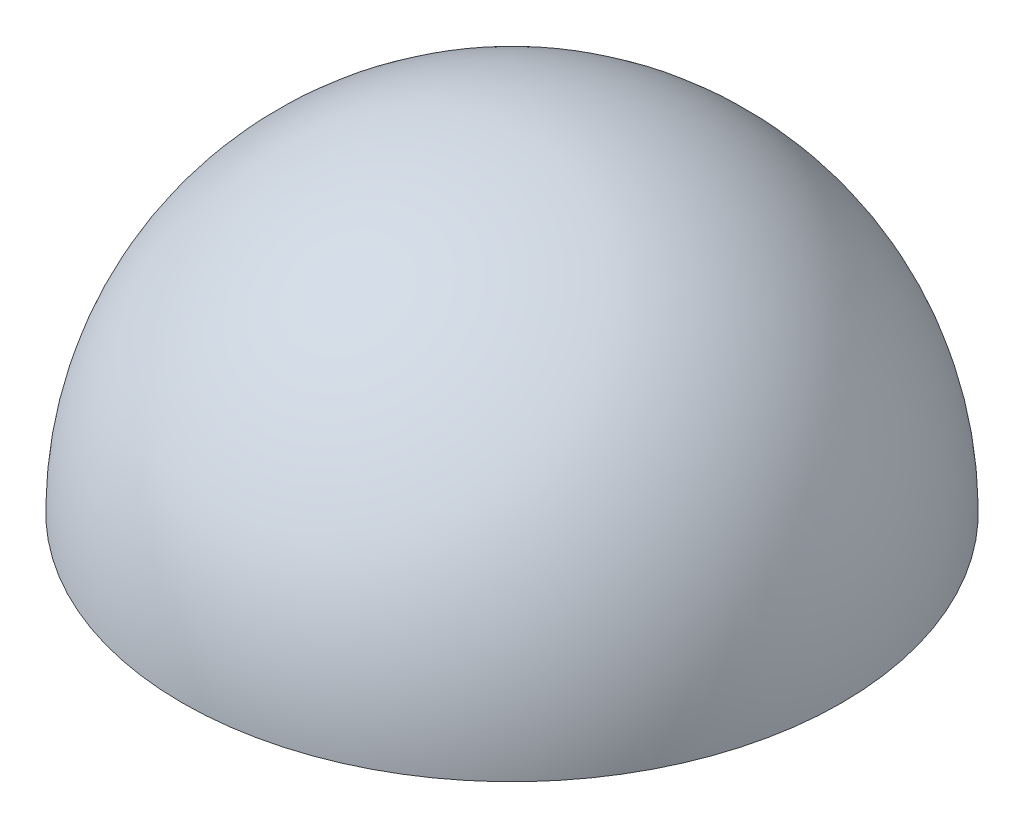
from build123d import *


with BuildPart() as part:
    # Sketch1 → Revolve1 (revolve)
    with BuildSketch(Plane.XY):
        with BuildLine():
            Line((0, 0), (40.69114094, 0))
            ThreePointArc((40.69114094, 0), (28.772981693, 28.772981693), (0, 40.69114094))
            Line((0, 40.69114094), (0, 0))
        make_face()
    revolve(axis=Axis((0, 0, 0), (0, -1, 0)))


solid = part.part
